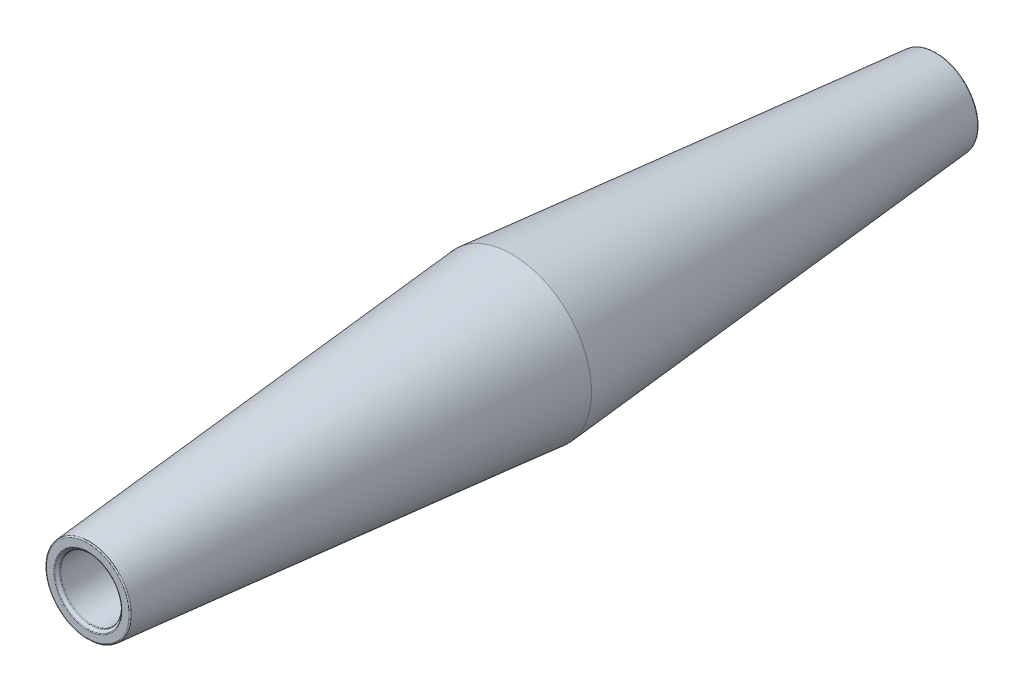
ISO-10303-21;
HEADER;
FILE_DESCRIPTION(('STEP AP214'),'2;1');
FILE_NAME('part.step','',(''),(''),'','','');
FILE_SCHEMA(('AUTOMOTIVE_DESIGN { 1 0 10303 214 1 1 1 1 }'));
ENDSEC;
DATA;
#1=APPLICATION_CONTEXT('core data for automotive mechanical design processes');
#2=APPLICATION_PROTOCOL_DEFINITION('international standard','automotive_design',2000,#1);
#3=PRODUCT_CONTEXT('',#1,'mechanical');
#4=PRODUCT('Part','Part','',(#3));
#5=PRODUCT_RELATED_PRODUCT_CATEGORY('part','',(#4));
#6=PRODUCT_DEFINITION_FORMATION('','',#4);
#7=PRODUCT_DEFINITION_CONTEXT('part definition',#1,'design');
#8=PRODUCT_DEFINITION('design','',#6,#7);
#9=PRODUCT_DEFINITION_SHAPE('','',#8);
#10=(LENGTH_UNIT() NAMED_UNIT(*) SI_UNIT(.MILLI.,.METRE.));
#11=(NAMED_UNIT(*) PLANE_ANGLE_UNIT() SI_UNIT($,.RADIAN.));
#12=(NAMED_UNIT(*) SI_UNIT($,.STERADIAN.) SOLID_ANGLE_UNIT());
#13=UNCERTAINTY_MEASURE_WITH_UNIT(LENGTH_MEASURE(1.E-05),#10,'distance_accuracy_value','');
#14=(GEOMETRIC_REPRESENTATION_CONTEXT(3) GLOBAL_UNCERTAINTY_ASSIGNED_CONTEXT((#13)) GLOBAL_UNIT_ASSIGNED_CONTEXT((#10,
#11,#12)) REPRESENTATION_CONTEXT('',''));
#15=CARTESIAN_POINT('',(0.,0.,0.));
#16=DIRECTION('',(0.,0.,1.));
#17=DIRECTION('',(1.,0.,0.));
#18=AXIS2_PLACEMENT_3D('',#15,#16,#17);
#19=CARTESIAN_POINT('',(0.,0.,70.));
#20=DIRECTION('',(0.,0.,-1.));
#21=DIRECTION('',(1.,0.,0.));
#22=AXIS2_PLACEMENT_3D('',#19,#20,#21);
#23=CONICAL_SURFACE('',#22,7.,0.0872664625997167);
#24=CARTESIAN_POINT('',(0.,0.,0.0174311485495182));
#25=DIRECTION('',(0.,0.,1.));
#26=DIRECTION('',(1.,0.,0.));
#27=AXIS2_PLACEMENT_3D('',#24,#25,#26);
#28=CIRCLE('',#27,13.1226814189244);
#29=CARTESIAN_POINT('',(13.1226814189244,0.,0.0174311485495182));
#30=VERTEX_POINT('',#29);
#31=EDGE_CURVE('E194',#30,#30,#28,.T.);
#32=ORIENTED_EDGE('',*,*,#31,.T.);
#33=EDGE_LOOP('',(#32));
#34=FACE_BOUND('',#33,.T.);
#35=CARTESIAN_POINT('',(0.,0.,69.8174311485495));
#36=DIRECTION('',(0.,0.,-1.));
#37=DIRECTION('',(-1.,0.,0.));
#38=AXIS2_PLACEMENT_3D('',#35,#36,#37);
#39=CIRCLE('',#38,7.01597270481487);
#40=CARTESIAN_POINT('',(-7.01597270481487,0.,69.8174311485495));
#41=VERTEX_POINT('',#40);
#42=EDGE_CURVE('E198',#41,#41,#39,.T.);
#43=ORIENTED_EDGE('',*,*,#42,.T.);
#44=EDGE_LOOP('',(#43));
#45=FACE_BOUND('',#44,.T.);
#46=ADVANCED_FACE('F122',(#34,#45),#23,.T.);
#47=CARTESIAN_POINT('',(0.,0.,70.));
#48=DIRECTION('',(0.,0.,1.));
#49=DIRECTION('',(1.,0.,0.));
#50=AXIS2_PLACEMENT_3D('',#47,#48,#49);
#51=PLANE('',#50);
#52=CARTESIAN_POINT('',(0.,0.,70.));
#53=DIRECTION('',(0.,0.,1.));
#54=DIRECTION('',(1.,0.,0.));
#55=AXIS2_PLACEMENT_3D('',#52,#53,#54);
#56=CIRCLE('',#55,6.81673376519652);
#57=CARTESIAN_POINT('',(6.81673376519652,0.,70.));
#58=VERTEX_POINT('',#57);
#59=EDGE_CURVE('E135',#58,#58,#56,.T.);
#60=ORIENTED_EDGE('',*,*,#59,.T.);
#61=EDGE_LOOP('',(#60));
#62=FACE_BOUND('',#61,.T.);
#63=CARTESIAN_POINT('',(0.,0.,70.));
#64=DIRECTION('',(0.,0.,1.));
#65=DIRECTION('',(1.,0.,0.));
#66=AXIS2_PLACEMENT_3D('',#63,#64,#65);
#67=CIRCLE('',#66,5.63284271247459);
#68=CARTESIAN_POINT('',(5.63284271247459,0.,70.));
#69=VERTEX_POINT('',#68);
#70=EDGE_CURVE('E140',#69,#69,#67,.F.);
#71=ORIENTED_EDGE('',*,*,#70,.T.);
#72=EDGE_LOOP('',(#71));
#73=FACE_BOUND('',#72,.T.);
#74=ADVANCED_FACE('F212',(#62,#73),#51,.T.);
#75=CARTESIAN_POINT('',(0.,0.,2.));
#76=DIRECTION('',(0.,0.,1.));
#77=DIRECTION('',(1.,0.,0.));
#78=AXIS2_PLACEMENT_3D('',#75,#76,#77);
#79=CYLINDRICAL_SURFACE('',#78,5.05);
#80=CARTESIAN_POINT('',(0.,0.,2.2));
#81=DIRECTION('',(0.,0.,1.));
#82=DIRECTION('',(1.,0.,0.));
#83=AXIS2_PLACEMENT_3D('',#80,#81,#82);
#84=CIRCLE('',#83,5.05);
#85=CARTESIAN_POINT('',(5.05,0.,2.2));
#86=VERTEX_POINT('',#85);
#87=EDGE_CURVE('E146',#86,#86,#84,.F.);
#88=ORIENTED_EDGE('',*,*,#87,.T.);
#89=EDGE_LOOP('',(#88));
#90=FACE_BOUND('',#89,.T.);
#91=CARTESIAN_POINT('',(0.,0.,69.4171572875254));
#92=DIRECTION('',(0.,0.,-1.));
#93=DIRECTION('',(-1.,0.,0.));
#94=AXIS2_PLACEMENT_3D('',#91,#92,#93);
#95=CIRCLE('',#94,5.05);
#96=CARTESIAN_POINT('',(-5.05,0.,69.4171572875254));
#97=VERTEX_POINT('',#96);
#98=EDGE_CURVE('E150',#97,#97,#95,.F.);
#99=ORIENTED_EDGE('',*,*,#98,.T.);
#100=EDGE_LOOP('',(#99));
#101=FACE_BOUND('',#100,.T.);
#102=ADVANCED_FACE('F215',(#90,#101),#79,.F.);
#103=CARTESIAN_POINT('',(0.,0.,2.));
#104=DIRECTION('',(0.,0.,1.));
#105=DIRECTION('',(1.,0.,0.));
#106=AXIS2_PLACEMENT_3D('',#103,#104,#105);
#107=PLANE('',#106);
#108=CARTESIAN_POINT('',(0.,0.,2.));
#109=DIRECTION('',(0.,0.,1.));
#110=DIRECTION('',(1.,0.,0.));
#111=AXIS2_PLACEMENT_3D('',#108,#109,#110);
#112=CIRCLE('',#111,4.85);
#113=CARTESIAN_POINT('',(4.85,0.,2.));
#114=VERTEX_POINT('',#113);
#115=EDGE_CURVE('E154',#114,#114,#112,.T.);
#116=ORIENTED_EDGE('',*,*,#115,.T.);
#117=EDGE_LOOP('',(#116));
#118=FACE_BOUND('',#117,.T.);
#119=ADVANCED_FACE('F239',(#118),#107,.T.);
#120=CARTESIAN_POINT('',(0.,0.,69.5));
#121=DIRECTION('',(0.,0.,1.));
#122=DIRECTION('',(1.,0.,0.));
#123=AXIS2_PLACEMENT_3D('',#120,#121,#122);
#124=CONICAL_SURFACE('',#123,5.05,0.785398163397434);
#125=CARTESIAN_POINT('',(0.,0.,69.9414213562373));
#126=DIRECTION('',(0.,0.,-1.));
#127=DIRECTION('',(-1.,0.,0.));
#128=AXIS2_PLACEMENT_3D('',#125,#126,#127);
#129=CIRCLE('',#128,5.49142135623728);
#130=CARTESIAN_POINT('',(-5.49142135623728,0.,69.9414213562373));
#131=VERTEX_POINT('',#130);
#132=EDGE_CURVE('E11',#131,#131,#129,.F.);
#133=ORIENTED_EDGE('',*,*,#132,.T.);
#134=EDGE_LOOP('',(#133));
#135=FACE_BOUND('',#134,.T.);
#136=CARTESIAN_POINT('',(0.,0.,69.5585786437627));
#137=DIRECTION('',(0.,0.,1.));
#138=DIRECTION('',(1.,0.,0.));
#139=AXIS2_PLACEMENT_3D('',#136,#137,#138);
#140=CIRCLE('',#139,5.10857864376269);
#141=CARTESIAN_POINT('',(5.10857864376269,0.,69.5585786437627));
#142=VERTEX_POINT('',#141);
#143=EDGE_CURVE('E130',#142,#142,#140,.F.);
#144=ORIENTED_EDGE('',*,*,#143,.T.);
#145=EDGE_LOOP('',(#144));
#146=FACE_BOUND('',#145,.T.);
#147=ADVANCED_FACE('F233',(#135,#146),#124,.F.);
#148=CARTESIAN_POINT('',(0.,0.,-70.));
#149=DIRECTION('',(0.,0.,1.));
#150=DIRECTION('',(1.,0.,0.));
#151=AXIS2_PLACEMENT_3D('',#148,#149,#150);
#152=CONICAL_SURFACE('',#151,7.,0.0872664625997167);
#153=CARTESIAN_POINT('',(0.,0.,-0.0174311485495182));
#154=DIRECTION('',(0.,0.,-1.));
#155=DIRECTION('',(-1.,0.,0.));
#156=AXIS2_PLACEMENT_3D('',#153,#154,#155);
#157=CIRCLE('',#156,13.1226814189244);
#158=CARTESIAN_POINT('',(-13.1226814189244,0.,-0.0174311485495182));
#159=VERTEX_POINT('',#158);
#160=EDGE_CURVE('E186',#159,#159,#157,.T.);
#161=ORIENTED_EDGE('',*,*,#160,.T.);
#162=EDGE_LOOP('',(#161));
#163=FACE_BOUND('',#162,.T.);
#164=CARTESIAN_POINT('',(0.,0.,-69.8174311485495));
#165=DIRECTION('',(0.,0.,1.));
#166=DIRECTION('',(1.,0.,0.));
#167=AXIS2_PLACEMENT_3D('',#164,#165,#166);
#168=CIRCLE('',#167,7.01597270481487);
#169=CARTESIAN_POINT('',(7.01597270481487,0.,-69.8174311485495));
#170=VERTEX_POINT('',#169);
#171=EDGE_CURVE('E190',#170,#170,#168,.T.);
#172=ORIENTED_EDGE('',*,*,#171,.T.);
#173=EDGE_LOOP('',(#172));
#174=FACE_BOUND('',#173,.T.);
#175=ADVANCED_FACE('F238',(#163,#174),#152,.T.);
#176=CARTESIAN_POINT('',(0.,0.,-70.));
#177=DIRECTION('',(0.,0.,-1.));
#178=DIRECTION('',(1.,0.,0.));
#179=AXIS2_PLACEMENT_3D('',#176,#177,#178);
#180=PLANE('',#179);
#181=CARTESIAN_POINT('',(0.,0.,-70.));
#182=DIRECTION('',(0.,0.,-1.));
#183=DIRECTION('',(-1.,0.,0.));
#184=AXIS2_PLACEMENT_3D('',#181,#182,#183);
#185=CIRCLE('',#184,6.81673376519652);
#186=CARTESIAN_POINT('',(-6.81673376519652,0.,-70.));
#187=VERTEX_POINT('',#186);
#188=EDGE_CURVE('E178',#187,#187,#185,.T.);
#189=ORIENTED_EDGE('',*,*,#188,.T.);
#190=EDGE_LOOP('',(#189));
#191=FACE_BOUND('',#190,.T.);
#192=CARTESIAN_POINT('',(0.,0.,-70.));
#193=DIRECTION('',(0.,0.,-1.));
#194=DIRECTION('',(-1.,0.,0.));
#195=AXIS2_PLACEMENT_3D('',#192,#193,#194);
#196=CIRCLE('',#195,5.63284271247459);
#197=CARTESIAN_POINT('',(-5.63284271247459,0.,-70.));
#198=VERTEX_POINT('',#197);
#199=EDGE_CURVE('E182',#198,#198,#196,.F.);
#200=ORIENTED_EDGE('',*,*,#199,.T.);
#201=EDGE_LOOP('',(#200));
#202=FACE_BOUND('',#201,.T.);
#203=ADVANCED_FACE('F282',(#191,#202),#180,.T.);
#204=CARTESIAN_POINT('',(0.,0.,-2.));
#205=DIRECTION('',(0.,0.,-1.));
#206=DIRECTION('',(1.,0.,0.));
#207=AXIS2_PLACEMENT_3D('',#204,#205,#206);
#208=CYLINDRICAL_SURFACE('',#207,5.05);
#209=CARTESIAN_POINT('',(0.,0.,-69.4171572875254));
#210=DIRECTION('',(0.,0.,-1.));
#211=DIRECTION('',(-1.,0.,0.));
#212=AXIS2_PLACEMENT_3D('',#209,#210,#211);
#213=CIRCLE('',#212,5.05);
#214=CARTESIAN_POINT('',(-5.05,0.,-69.4171572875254));
#215=VERTEX_POINT('',#214);
#216=EDGE_CURVE('E162',#215,#215,#213,.T.);
#217=ORIENTED_EDGE('',*,*,#216,.T.);
#218=EDGE_LOOP('',(#217));
#219=FACE_BOUND('',#218,.T.);
#220=CARTESIAN_POINT('',(0.,0.,-2.2));
#221=DIRECTION('',(0.,0.,-1.));
#222=DIRECTION('',(-1.,0.,0.));
#223=AXIS2_PLACEMENT_3D('',#220,#221,#222);
#224=CIRCLE('',#223,5.05);
#225=CARTESIAN_POINT('',(-5.05,0.,-2.2));
#226=VERTEX_POINT('',#225);
#227=EDGE_CURVE('E166',#226,#226,#224,.F.);
#228=ORIENTED_EDGE('',*,*,#227,.T.);
#229=EDGE_LOOP('',(#228));
#230=FACE_BOUND('',#229,.T.);
#231=ADVANCED_FACE('F286',(#219,#230),#208,.F.);
#232=CARTESIAN_POINT('',(0.,0.,-2.));
#233=DIRECTION('',(0.,0.,-1.));
#234=DIRECTION('',(1.,0.,0.));
#235=AXIS2_PLACEMENT_3D('',#232,#233,#234);
#236=PLANE('',#235);
#237=CARTESIAN_POINT('',(0.,0.,-2.));
#238=DIRECTION('',(0.,0.,-1.));
#239=DIRECTION('',(-1.,0.,0.));
#240=AXIS2_PLACEMENT_3D('',#237,#238,#239);
#241=CIRCLE('',#240,4.85);
#242=CARTESIAN_POINT('',(-4.85,0.,-2.));
#243=VERTEX_POINT('',#242);
#244=EDGE_CURVE('E158',#243,#243,#241,.T.);
#245=ORIENTED_EDGE('',*,*,#244,.T.);
#246=EDGE_LOOP('',(#245));
#247=FACE_BOUND('',#246,.T.);
#248=ADVANCED_FACE('F278',(#247),#236,.T.);
#249=CARTESIAN_POINT('',(0.,0.,-69.5));
#250=DIRECTION('',(0.,0.,-1.));
#251=DIRECTION('',(1.,0.,0.));
#252=AXIS2_PLACEMENT_3D('',#249,#250,#251);
#253=CONICAL_SURFACE('',#252,5.05,0.785398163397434);
#254=CARTESIAN_POINT('',(0.,0.,-69.9414213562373));
#255=DIRECTION('',(0.,0.,1.));
#256=DIRECTION('',(1.,0.,0.));
#257=AXIS2_PLACEMENT_3D('',#254,#255,#256);
#258=CIRCLE('',#257,5.49142135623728);
#259=CARTESIAN_POINT('',(5.49142135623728,0.,-69.9414213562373));
#260=VERTEX_POINT('',#259);
#261=EDGE_CURVE('E170',#260,#260,#258,.F.);
#262=ORIENTED_EDGE('',*,*,#261,.T.);
#263=EDGE_LOOP('',(#262));
#264=FACE_BOUND('',#263,.T.);
#265=CARTESIAN_POINT('',(0.,0.,-69.5585786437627));
#266=DIRECTION('',(0.,0.,-1.));
#267=DIRECTION('',(-1.,0.,0.));
#268=AXIS2_PLACEMENT_3D('',#265,#266,#267);
#269=CIRCLE('',#268,5.10857864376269);
#270=CARTESIAN_POINT('',(-5.10857864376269,0.,-69.5585786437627));
#271=VERTEX_POINT('',#270);
#272=EDGE_CURVE('E174',#271,#271,#269,.F.);
#273=ORIENTED_EDGE('',*,*,#272,.T.);
#274=EDGE_LOOP('',(#273));
#275=FACE_BOUND('',#274,.T.);
#276=ADVANCED_FACE('F244',(#264,#275),#253,.F.);
#277=CARTESIAN_POINT('',(0.,0.,0.));
#278=DIRECTION('',(0.,0.,-1.));
#279=DIRECTION('',(-1.,0.,0.));
#280=AXIS2_PLACEMENT_3D('',#277,#278,#279);
#281=TOROIDAL_SURFACE('',#280,12.923442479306,0.2);
#282=ORIENTED_EDGE('',*,*,#160,.F.);
#283=EDGE_LOOP('',(#282));
#284=FACE_BOUND('',#283,.T.);
#285=ORIENTED_EDGE('',*,*,#31,.F.);
#286=EDGE_LOOP('',(#285));
#287=FACE_BOUND('',#286,.T.);
#288=ADVANCED_FACE('F240',(#284,#287),#281,.T.);
#289=CARTESIAN_POINT('',(0.,0.,-69.8));
#290=DIRECTION('',(0.,0.,-1.));
#291=DIRECTION('',(-1.,0.,0.));
#292=AXIS2_PLACEMENT_3D('',#289,#290,#291);
#293=TOROIDAL_SURFACE('',#292,6.81673376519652,0.2);
#294=ORIENTED_EDGE('',*,*,#188,.F.);
#295=EDGE_LOOP('',(#294));
#296=FACE_BOUND('',#295,.T.);
#297=ORIENTED_EDGE('',*,*,#171,.F.);
#298=EDGE_LOOP('',(#297));
#299=FACE_BOUND('',#298,.T.);
#300=ADVANCED_FACE('F243',(#296,#299),#293,.T.);
#301=CARTESIAN_POINT('',(0.,0.,-69.8));
#302=DIRECTION('',(0.,0.,-1.));
#303=DIRECTION('',(-1.,0.,0.));
#304=AXIS2_PLACEMENT_3D('',#301,#302,#303);
#305=TOROIDAL_SURFACE('',#304,5.63284271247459,0.2);
#306=ORIENTED_EDGE('',*,*,#199,.F.);
#307=EDGE_LOOP('',(#306));
#308=FACE_BOUND('',#307,.T.);
#309=ORIENTED_EDGE('',*,*,#261,.F.);
#310=EDGE_LOOP('',(#309));
#311=FACE_BOUND('',#310,.T.);
#312=ADVANCED_FACE('F248',(#308,#311),#305,.T.);
#313=CARTESIAN_POINT('',(0.,0.,-69.4171572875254));
#314=DIRECTION('',(0.,0.,-1.));
#315=DIRECTION('',(-1.,0.,0.));
#316=AXIS2_PLACEMENT_3D('',#313,#314,#315);
#317=TOROIDAL_SURFACE('',#316,5.25,0.2);
#318=ORIENTED_EDGE('',*,*,#216,.F.);
#319=EDGE_LOOP('',(#318));
#320=FACE_BOUND('',#319,.T.);
#321=ORIENTED_EDGE('',*,*,#272,.F.);
#322=EDGE_LOOP('',(#321));
#323=FACE_BOUND('',#322,.T.);
#324=ADVANCED_FACE('F252',(#320,#323),#317,.T.);
#325=CARTESIAN_POINT('',(0.,0.,-2.2));
#326=DIRECTION('',(0.,0.,-1.));
#327=DIRECTION('',(-1.,0.,0.));
#328=AXIS2_PLACEMENT_3D('',#325,#326,#327);
#329=TOROIDAL_SURFACE('',#328,4.85,0.2);
#330=ORIENTED_EDGE('',*,*,#244,.F.);
#331=EDGE_LOOP('',(#330));
#332=FACE_BOUND('',#331,.T.);
#333=ORIENTED_EDGE('',*,*,#227,.F.);
#334=EDGE_LOOP('',(#333));
#335=FACE_BOUND('',#334,.T.);
#336=ADVANCED_FACE('F256',(#332,#335),#329,.F.);
#337=CARTESIAN_POINT('',(0.,0.,2.2));
#338=DIRECTION('',(0.,0.,1.));
#339=DIRECTION('',(1.,0.,0.));
#340=AXIS2_PLACEMENT_3D('',#337,#338,#339);
#341=TOROIDAL_SURFACE('',#340,4.85,0.2);
#342=ORIENTED_EDGE('',*,*,#87,.F.);
#343=EDGE_LOOP('',(#342));
#344=FACE_BOUND('',#343,.T.);
#345=ORIENTED_EDGE('',*,*,#115,.F.);
#346=EDGE_LOOP('',(#345));
#347=FACE_BOUND('',#346,.T.);
#348=ADVANCED_FACE('F208',(#344,#347),#341,.F.);
#349=CARTESIAN_POINT('',(0.,0.,69.8));
#350=DIRECTION('',(0.,0.,1.));
#351=DIRECTION('',(1.,0.,0.));
#352=AXIS2_PLACEMENT_3D('',#349,#350,#351);
#353=TOROIDAL_SURFACE('',#352,6.81673376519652,0.2);
#354=ORIENTED_EDGE('',*,*,#42,.F.);
#355=EDGE_LOOP('',(#354));
#356=FACE_BOUND('',#355,.T.);
#357=ORIENTED_EDGE('',*,*,#59,.F.);
#358=EDGE_LOOP('',(#357));
#359=FACE_BOUND('',#358,.T.);
#360=ADVANCED_FACE('F204',(#356,#359),#353,.T.);
#361=CARTESIAN_POINT('',(0.,0.,69.8));
#362=DIRECTION('',(0.,0.,1.));
#363=DIRECTION('',(1.,0.,0.));
#364=AXIS2_PLACEMENT_3D('',#361,#362,#363);
#365=TOROIDAL_SURFACE('',#364,5.63284271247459,0.2);
#366=ORIENTED_EDGE('',*,*,#132,.F.);
#367=EDGE_LOOP('',(#366));
#368=FACE_BOUND('',#367,.T.);
#369=ORIENTED_EDGE('',*,*,#70,.F.);
#370=EDGE_LOOP('',(#369));
#371=FACE_BOUND('',#370,.T.);
#372=ADVANCED_FACE('F207',(#368,#371),#365,.T.);
#373=CARTESIAN_POINT('',(0.,0.,69.4171572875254));
#374=DIRECTION('',(0.,0.,-1.));
#375=DIRECTION('',(-1.,0.,0.));
#376=AXIS2_PLACEMENT_3D('',#373,#374,#375);
#377=TOROIDAL_SURFACE('',#376,5.25,0.2);
#378=ORIENTED_EDGE('',*,*,#143,.F.);
#379=EDGE_LOOP('',(#378));
#380=FACE_BOUND('',#379,.T.);
#381=ORIENTED_EDGE('',*,*,#98,.F.);
#382=EDGE_LOOP('',(#381));
#383=FACE_BOUND('',#382,.T.);
#384=ADVANCED_FACE('F124',(#380,#383),#377,.T.);
#385=CLOSED_SHELL('',(#46,#74,#102,#119,#147,#175,#203,#231,#248,#276,#288,#300,#312,#324,#336,
#348,#360,#372,#384));
#386=MANIFOLD_SOLID_BREP('B2',#385);
#387=ADVANCED_BREP_SHAPE_REPRESENTATION('',(#18,#386),#14);
#388=SHAPE_DEFINITION_REPRESENTATION(#9,#387);
ENDSEC;
END-ISO-10303-21;
